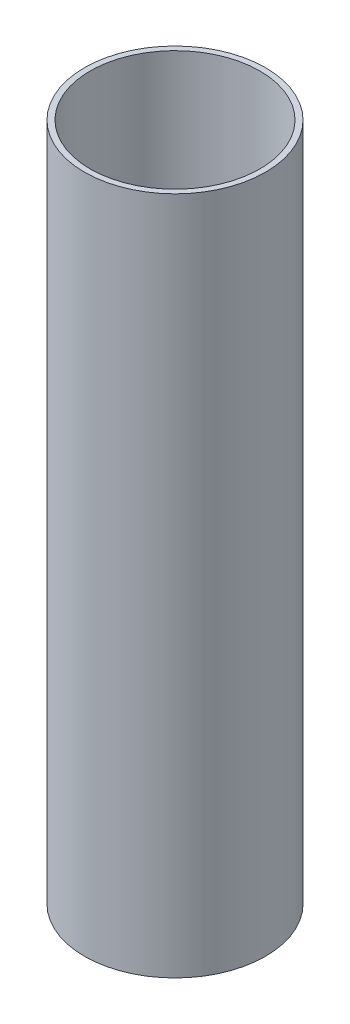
from build123d import *

# Parameters (mm, degrees)
SKETCH1_R           = 50.8
SKETCH1_R_2         = 47.625
BOSS_EXTRUDE1_DEPTH = 381


with BuildPart() as part:
    # Sketch1 → Boss-Extrude1 (new body)
    with BuildSketch(Plane(origin=(0, 0, 0), x_dir=(1, 0, 0), z_dir=(0, 1, 0))):
        with Locations(Location((0, 0, 0), (0, 0, 270))):
            Circle(SKETCH1_R)
        with Locations(Location((0, 0, 0), (0, 0, 270))):
            Circle(SKETCH1_R_2, mode=Mode.SUBTRACT)
    extrude(amount=BOSS_EXTRUDE1_DEPTH)


solid = part.part
